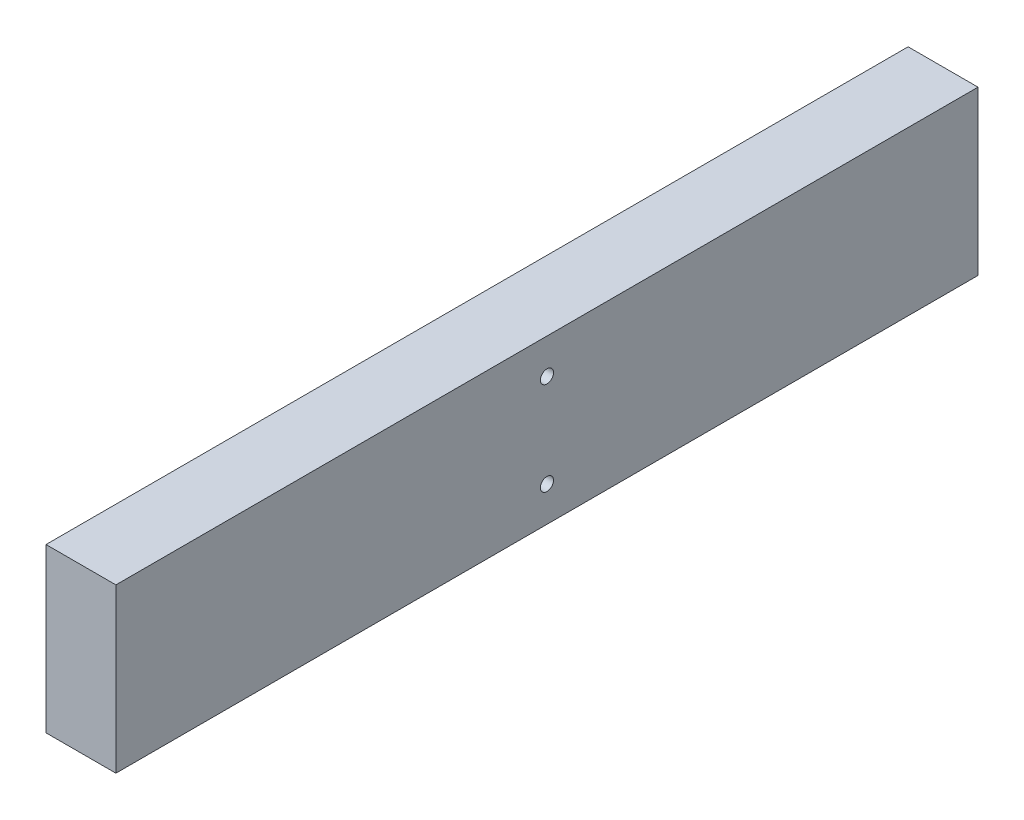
from build123d import *

# Parameters (mm, degrees)
SKETCH1_W                       = 38.1
SKETCH1_H                       = 88.9
BOSS_EXTRUDE1_DEPTH             = 469.9
F_9_32_0_28125_DIAMETER_HOLE1_D = 7.14375


with BuildPart() as part:
    # Sketch1 → Boss-Extrude1 (new body)
    with BuildSketch(Plane.XY):
        Rectangle(SKETCH1_W, SKETCH1_H)
    extrude(amount=BOSS_EXTRUDE1_DEPTH)

    # 9_32 _0.28125_ Diameter Hole1 (through all)
    with Locations(Plane(origin=(19.05, 0, 0), x_dir=(0, 0, -1), z_dir=(1, 0, 0))):
        with Locations((-234.95, 25.4), (-234.95, -25.4)):
            Hole(F_9_32_0_28125_DIAMETER_HOLE1_D / 2)


solid = part.part
